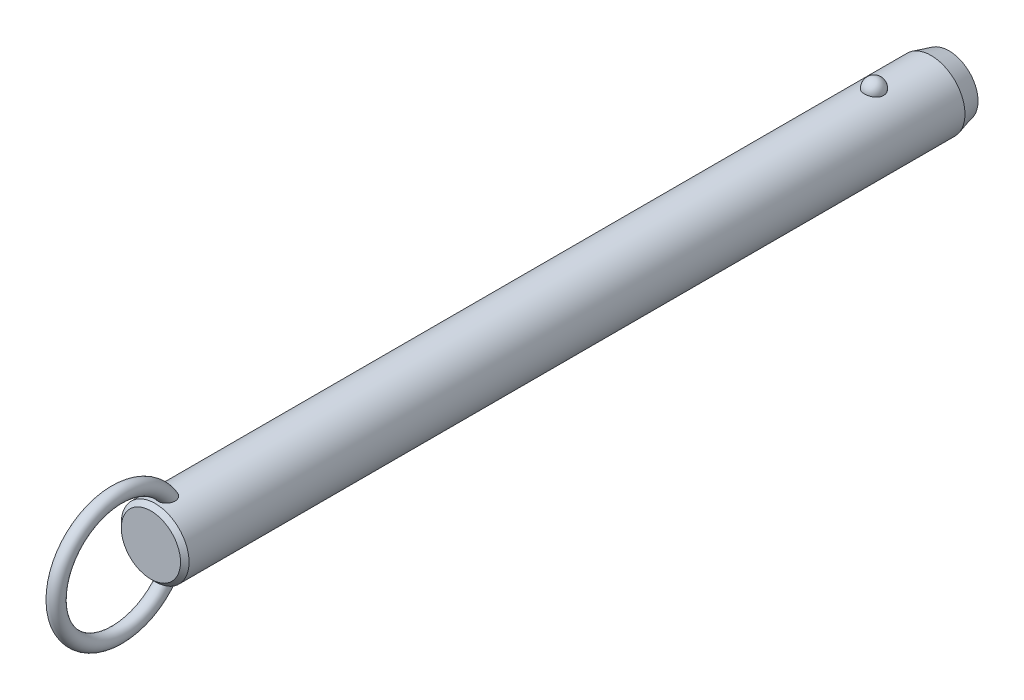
ISO-10303-21;
HEADER;
FILE_DESCRIPTION(('STEP AP214'),'2;1');
FILE_NAME('part.step','',(''),(''),'','','');
FILE_SCHEMA(('AUTOMOTIVE_DESIGN { 1 0 10303 214 1 1 1 1 }'));
ENDSEC;
DATA;
#1=APPLICATION_CONTEXT('core data for automotive mechanical design processes');
#2=APPLICATION_PROTOCOL_DEFINITION('international standard','automotive_design',2000,#1);
#3=PRODUCT_CONTEXT('',#1,'mechanical');
#4=PRODUCT('Part','Part','',(#3));
#5=PRODUCT_RELATED_PRODUCT_CATEGORY('part','',(#4));
#6=PRODUCT_DEFINITION_FORMATION('','',#4);
#7=PRODUCT_DEFINITION_CONTEXT('part definition',#1,'design');
#8=PRODUCT_DEFINITION('design','',#6,#7);
#9=PRODUCT_DEFINITION_SHAPE('','',#8);
#10=(LENGTH_UNIT() NAMED_UNIT(*) SI_UNIT(.MILLI.,.METRE.));
#11=(NAMED_UNIT(*) PLANE_ANGLE_UNIT() SI_UNIT($,.RADIAN.));
#12=(NAMED_UNIT(*) SI_UNIT($,.STERADIAN.) SOLID_ANGLE_UNIT());
#13=UNCERTAINTY_MEASURE_WITH_UNIT(LENGTH_MEASURE(1.E-05),#10,'distance_accuracy_value','');
#14=(GEOMETRIC_REPRESENTATION_CONTEXT(3) GLOBAL_UNCERTAINTY_ASSIGNED_CONTEXT((#13)) GLOBAL_UNIT_ASSIGNED_CONTEXT((#10,
#11,#12)) REPRESENTATION_CONTEXT('',''));
#15=CARTESIAN_POINT('',(0.,0.,0.));
#16=DIRECTION('',(0.,0.,1.));
#17=DIRECTION('',(1.,0.,0.));
#18=AXIS2_PLACEMENT_3D('',#15,#16,#17);
#19=CARTESIAN_POINT('',(0.,0.,190.5));
#20=DIRECTION('',(0.,0.,-1.));
#21=DIRECTION('',(-1.,0.,0.));
#22=AXIS2_PLACEMENT_3D('',#19,#20,#21);
#23=CYLINDRICAL_SURFACE('',#22,9.5);
#24=CARTESIAN_POINT('',(2.67259918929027,9.11631578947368,-2.70000000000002));
#25=CARTESIAN_POINT('',(2.6725968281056,9.11631786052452,-2.54909854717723));
#26=CARTESIAN_POINT('',(2.66030567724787,9.11994722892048,-2.39816735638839));
#27=CARTESIAN_POINT('',(2.6114347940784,9.13405924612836,-2.10058568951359));
#28=CARTESIAN_POINT('',(2.57484658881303,9.14454428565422,-1.95393672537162));
#29=CARTESIAN_POINT('',(2.47830875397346,9.17117631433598,-1.66916069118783));
#30=CARTESIAN_POINT('',(2.41836936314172,9.18732082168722,-1.53102991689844));
#31=CARTESIAN_POINT('',(2.27661331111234,9.22346780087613,-1.26705393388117));
#32=CARTESIAN_POINT('',(2.19479699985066,9.24347021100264,-1.14120852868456));
#33=CARTESIAN_POINT('',(2.01085282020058,9.28522401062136,-0.904632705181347));
#34=CARTESIAN_POINT('',(1.90862396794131,9.30698376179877,-0.793982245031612));
#35=CARTESIAN_POINT('',(1.6867437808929,9.34973971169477,-0.591607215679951));
#36=CARTESIAN_POINT('',(1.56709244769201,9.37073591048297,-0.499882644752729));
#37=CARTESIAN_POINT('',(1.31393976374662,9.40956370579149,-0.33816762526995));
#38=CARTESIAN_POINT('',(1.18048026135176,9.42740444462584,-0.268113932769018));
#39=CARTESIAN_POINT('',(0.903154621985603,9.45799906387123,-0.151390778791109));
#40=CARTESIAN_POINT('',(0.759289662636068,9.47075351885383,-0.104718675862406));
#41=CARTESIAN_POINT('',(0.468074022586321,9.48956256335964,-0.0367633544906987));
#42=CARTESIAN_POINT('',(0.320836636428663,9.49573643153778,-0.015027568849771));
#43=CARTESIAN_POINT('',(0.0246714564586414,9.50112183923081,0.0039619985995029));
#44=CARTESIAN_POINT('',(-0.124256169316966,9.50033406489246,0.00121819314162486));
#45=CARTESIAN_POINT('',(-0.417264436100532,9.4919475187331,-0.0284441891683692));
#46=CARTESIAN_POINT('',(-0.56138413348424,9.48444885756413,-0.0550074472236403));
#47=CARTESIAN_POINT('',(-0.842986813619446,9.46357853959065,-0.131064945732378));
#48=CARTESIAN_POINT('',(-0.980469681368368,9.450206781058,-0.180559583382));
#49=CARTESIAN_POINT('',(-1.24585005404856,9.41890822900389,-0.301476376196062));
#50=CARTESIAN_POINT('',(-1.37368611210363,9.40095498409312,-0.373026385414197));
#51=CARTESIAN_POINT('',(-1.61552738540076,9.3624296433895,-0.53602540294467));
#52=CARTESIAN_POINT('',(-1.72953116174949,9.34185727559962,-0.62747647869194));
#53=CARTESIAN_POINT('',(-1.9429225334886,9.29984568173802,-0.829844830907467));
#54=CARTESIAN_POINT('',(-2.04198021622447,9.27839736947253,-0.941108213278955));
#55=CARTESIAN_POINT('',(-2.2202646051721,9.23735994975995,-1.17883414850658));
#56=CARTESIAN_POINT('',(-2.29948985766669,9.21777097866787,-1.30529781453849));
#57=CARTESIAN_POINT('',(-2.43697287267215,9.18238994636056,-1.57158566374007));
#58=CARTESIAN_POINT('',(-2.49497068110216,9.16664569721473,-1.71155057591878));
#59=CARTESIAN_POINT('',(-2.5872073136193,9.14104303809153,-1.99961197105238));
#60=CARTESIAN_POINT('',(-2.62144683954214,9.13118445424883,-2.1477082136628));
#61=CARTESIAN_POINT('',(-2.66521466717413,9.11850622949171,-2.44715424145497));
#62=CARTESIAN_POINT('',(-2.67484831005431,9.11565658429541,-2.59848735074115));
#63=CARTESIAN_POINT('',(-2.66946735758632,9.11723375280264,-2.90067317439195));
#64=CARTESIAN_POINT('',(-2.65445345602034,9.12166036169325,-3.05152590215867));
#65=CARTESIAN_POINT('',(-2.6002971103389,9.13724422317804,-3.34766110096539));
#66=CARTESIAN_POINT('',(-2.56127978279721,9.14836656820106,-3.49296833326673));
#67=CARTESIAN_POINT('',(-2.46018844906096,9.17606676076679,-3.77477535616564));
#68=CARTESIAN_POINT('',(-2.39811349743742,9.19264483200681,-3.91127478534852));
#69=CARTESIAN_POINT('',(-2.25202303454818,9.22952198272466,-4.17244273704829));
#70=CARTESIAN_POINT('',(-2.16788714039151,9.24984129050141,-4.29704106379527));
#71=CARTESIAN_POINT('',(-1.9799408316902,9.29188255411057,-4.53013066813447));
#72=CARTESIAN_POINT('',(-1.87612963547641,9.31360456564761,-4.63862130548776));
#73=CARTESIAN_POINT('',(-1.65105429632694,9.35612959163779,-4.83690299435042));
#74=CARTESIAN_POINT('',(-1.52972405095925,9.37692871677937,-4.9266199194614));
#75=CARTESIAN_POINT('',(-1.27318250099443,9.41518970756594,-5.08429106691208));
#76=CARTESIAN_POINT('',(-1.13797219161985,9.432651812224,-5.15224684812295));
#77=CARTESIAN_POINT('',(-0.859280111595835,9.46208255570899,-5.26371827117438));
#78=CARTESIAN_POINT('',(-0.715925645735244,9.47411833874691,-5.30753421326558));
#79=CARTESIAN_POINT('',(-0.423550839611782,9.4916822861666,-5.37076321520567));
#80=CARTESIAN_POINT('',(-0.2745312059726,9.49721125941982,-5.39017930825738));
#81=CARTESIAN_POINT('',(0.0218446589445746,9.50110860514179,-5.40390587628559));
#82=CARTESIAN_POINT('',(0.16917707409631,9.49961381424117,-5.39869609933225));
#83=CARTESIAN_POINT('',(0.460808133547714,9.48993906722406,-5.36441955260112));
#84=CARTESIAN_POINT('',(0.605106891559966,9.48175936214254,-5.33535367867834));
#85=CARTESIAN_POINT('',(0.886027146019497,9.4596376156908,-5.25435587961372));
#86=CARTESIAN_POINT('',(1.02267710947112,9.44571881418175,-5.20251612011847));
#87=CARTESIAN_POINT('',(1.28523827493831,9.41358993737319,-5.07741549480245));
#88=CARTESIAN_POINT('',(1.41114877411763,9.39537958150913,-5.00415322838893));
#89=CARTESIAN_POINT('',(1.65085227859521,9.3562644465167,-4.83684599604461));
#90=CARTESIAN_POINT('',(1.76442346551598,9.33532178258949,-4.74249218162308));
#91=CARTESIAN_POINT('',(1.97425672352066,9.29321198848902,-4.53620389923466));
#92=CARTESIAN_POINT('',(2.07051582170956,9.27204482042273,-4.42426641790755));
#93=CARTESIAN_POINT('',(2.24490086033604,9.23139221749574,-4.18363183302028));
#94=CARTESIAN_POINT('',(2.32267019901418,9.21194380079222,-4.05466990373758));
#95=CARTESIAN_POINT('',(2.45584092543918,9.1773419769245,-3.78517836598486));
#96=CARTESIAN_POINT('',(2.51124979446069,9.16218713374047,-3.644652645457));
#97=CARTESIAN_POINT('',(2.59380876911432,9.13913522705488,-3.37104301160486));
#98=CARTESIAN_POINT('',(2.62330266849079,9.13064624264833,-3.23871053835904));
#99=CARTESIAN_POINT('',(2.66269870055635,9.11923566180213,-2.97092664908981));
#100=CARTESIAN_POINT('',(2.67260130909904,9.11631393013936,-2.83547530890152));
#101=CARTESIAN_POINT('',(2.67259918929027,9.11631578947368,-2.70000000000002));
#102=B_SPLINE_CURVE_WITH_KNOTS('',3,(#24,#25,#26,#27,#28,#29,#30,#31,#32,#33,#34,#35,#36,#37,
#38,#39,#40,#41,#42,#43,#44,#45,#46,#47,#48,#49,#50,#51,#52,#53,#54,#55,#56,#57,#58,#59,#60,#61,
#62,#63,#64,#65,#66,#67,#68,#69,#70,#71,#72,#73,#74,#75,#76,#77,#78,#79,#80,#81,#82,#83,#84,#85,
#86,#87,#88,#89,#90,#91,#92,#93,#94,#95,#96,#97,#98,#99,#100,#101),.UNSPECIFIED.,.T.,.F.,(4,2,2,
2,2,2,2,2,2,2,2,2,2,2,2,2,2,2,2,2,2,2,2,2,2,2,2,2,2,2,2,2,2,2,2,2,2,2,4),(0.,0.452217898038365,
0.904593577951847,1.35677112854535,1.80894144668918,2.26340676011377,2.71787203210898,
3.17099820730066,3.62407318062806,4.0687883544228,4.51345969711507,4.95160616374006,
5.38976021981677,5.83050358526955,6.27129275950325,6.72071308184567,7.17016633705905,
7.62495278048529,8.07972578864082,8.53254856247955,8.98535859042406,9.43582813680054,
9.88631615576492,10.3393155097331,10.7923328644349,11.2471065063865,11.7018475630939,
12.150795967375,12.5996885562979,13.0398725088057,13.4800399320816,13.9184421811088,
14.3568730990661,14.802202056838,15.2476074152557,15.7010097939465,16.1542603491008,
16.5602594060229,16.9662486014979),.UNSPECIFIED.);
#103=CARTESIAN_POINT('',(2.67259918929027,9.11631578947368,-2.70000000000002));
#104=VERTEX_POINT('',#103);
#105=EDGE_CURVE('E41',#104,#104,#102,.T.);
#106=ORIENTED_EDGE('',*,*,#105,.T.);
#107=EDGE_LOOP('',(#106));
#108=FACE_BOUND('',#107,.T.);
#109=CARTESIAN_POINT('',(0.,0.,198.82));
#110=DIRECTION('',(0.,0.,1.));
#111=DIRECTION('',(1.,0.,0.));
#112=AXIS2_PLACEMENT_3D('',#109,#110,#111);
#113=CIRCLE('',#112,9.5);
#114=CARTESIAN_POINT('',(9.5,0.,198.82));
#115=VERTEX_POINT('',#114);
#116=EDGE_CURVE('E10',#115,#115,#113,.F.);
#117=ORIENTED_EDGE('',*,*,#116,.T.);
#118=EDGE_LOOP('',(#117));
#119=FACE_BOUND('',#118,.T.);
#120=CARTESIAN_POINT('',(-0.697062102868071,-9.47439269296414,193.167808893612));
#121=CARTESIAN_POINT('',(-0.799579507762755,-9.46685146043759,193.207482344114));
#122=CARTESIAN_POINT('',(-0.898575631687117,-9.45788043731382,193.2559309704));
#123=CARTESIAN_POINT('',(-1.08670047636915,-9.43811593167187,193.368868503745));
#124=CARTESIAN_POINT('',(-1.17583204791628,-9.42732297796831,193.433352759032));
#125=CARTESIAN_POINT('',(-1.34179806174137,-9.40513672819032,193.576209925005));
#126=CARTESIAN_POINT('',(-1.41865133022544,-9.39374438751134,193.654561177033));
#127=CARTESIAN_POINT('',(-1.55860047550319,-9.37154196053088,193.822752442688));
#128=CARTESIAN_POINT('',(-1.62169476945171,-9.3607319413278,193.91259377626));
#129=CARTESIAN_POINT('',(-1.73527695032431,-9.34035749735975,194.104500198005));
#130=CARTESIAN_POINT('',(-1.78522266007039,-9.33085270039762,194.206891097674));
#131=CARTESIAN_POINT('',(-1.86924997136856,-9.3143834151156,194.418148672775));
#132=CARTESIAN_POINT('',(-1.90332570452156,-9.30741986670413,194.527017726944));
#133=CARTESIAN_POINT('',(-1.95893603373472,-9.29588482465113,194.760473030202));
#134=CARTESIAN_POINT('',(-1.97872420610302,-9.29165182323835,194.885489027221));
#135=CARTESIAN_POINT('',(-2.00062129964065,-9.28695978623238,195.137080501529));
#136=CARTESIAN_POINT('',(-2.00272284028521,-9.28650232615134,195.263656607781));
#137=CARTESIAN_POINT('',(-1.98958876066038,-9.28932750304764,195.536815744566));
#138=CARTESIAN_POINT('',(-1.97143366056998,-9.2932400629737,195.683251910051));
#139=CARTESIAN_POINT('',(-1.91479925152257,-9.30507151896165,195.972062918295));
#140=CARTESIAN_POINT('',(-1.87629122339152,-9.31299607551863,196.114431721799));
#141=CARTESIAN_POINT('',(-1.77225683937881,-9.33340232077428,196.415172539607));
#142=CARTESIAN_POINT('',(-1.70334898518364,-9.34641636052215,196.572369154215));
#143=CARTESIAN_POINT('',(-1.58111062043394,-9.36759153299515,196.797517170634));
#144=CARTESIAN_POINT('',(-1.53721459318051,-9.37492619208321,196.870796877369));
#145=CARTESIAN_POINT('',(-1.4430263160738,-9.38988566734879,197.01307405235));
#146=CARTESIAN_POINT('',(-1.39273721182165,-9.39751033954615,197.082073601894));
#147=CARTESIAN_POINT('',(-1.26775962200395,-9.41530678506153,197.236983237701));
#148=CARTESIAN_POINT('',(-1.19052326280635,-9.42548108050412,197.320871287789));
#149=CARTESIAN_POINT('',(-1.02420241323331,-9.44499825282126,197.476008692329));
#150=CARTESIAN_POINT('',(-0.93513986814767,-9.45434261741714,197.547280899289));
#151=CARTESIAN_POINT('',(-0.766610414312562,-9.46930670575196,197.658695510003));
#152=CARTESIAN_POINT('',(-0.689439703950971,-9.47529223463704,197.702235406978));
#153=CARTESIAN_POINT('',(-0.528942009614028,-9.48560294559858,197.77631336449));
#154=CARTESIAN_POINT('',(-0.445620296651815,-9.48992953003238,197.806862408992));
#155=CARTESIAN_POINT('',(-0.273901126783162,-9.49644161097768,197.852579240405));
#156=CARTESIAN_POINT('',(-0.18546574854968,-9.49860811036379,197.86761059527));
#157=CARTESIAN_POINT('',(-0.00734541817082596,-9.5004135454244,197.880149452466));
#158=CARTESIAN_POINT('',(0.0823387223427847,-9.50005405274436,197.877667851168));
#159=CARTESIAN_POINT('',(0.247679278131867,-9.49708301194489,197.856995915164));
#160=CARTESIAN_POINT('',(0.323620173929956,-9.49477609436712,197.840930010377));
#161=CARTESIAN_POINT('',(0.471981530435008,-9.48855917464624,197.797172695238));
#162=CARTESIAN_POINT('',(0.544400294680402,-9.48464840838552,197.769475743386));
#163=CARTESIAN_POINT('',(0.708947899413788,-9.47398336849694,197.69280266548));
#164=CARTESIAN_POINT('',(0.799149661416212,-9.46671310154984,197.639774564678));
#165=CARTESIAN_POINT('',(0.969783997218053,-9.45076225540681,197.519973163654));
#166=CARTESIAN_POINT('',(1.050194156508,-9.44207854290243,197.453169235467));
#167=CARTESIAN_POINT('',(1.23092343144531,-9.42051459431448,197.280759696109));
#168=CARTESIAN_POINT('',(1.32652499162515,-9.40733378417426,197.17026193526));
#169=CARTESIAN_POINT('',(1.49893121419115,-9.38140745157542,196.935561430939));
#170=CARTESIAN_POINT('',(1.5757161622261,-9.36866239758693,196.811344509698));
#171=CARTESIAN_POINT('',(1.71285426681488,-9.34457644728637,196.549389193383));
#172=CARTESIAN_POINT('',(1.77266365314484,-9.33328726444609,196.41136233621));
#173=CARTESIAN_POINT('',(1.87239208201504,-9.31379209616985,196.128051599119));
#174=CARTESIAN_POINT('',(1.91230158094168,-9.3055875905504,195.982764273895));
#175=CARTESIAN_POINT('',(1.97604189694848,-9.29228394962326,195.662028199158));
#176=CARTESIAN_POINT('',(1.9958743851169,-9.28797202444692,195.485724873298));
#177=CARTESIAN_POINT('',(2.0029570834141,-9.28645519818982,195.132414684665));
#178=CARTESIAN_POINT('',(1.99025930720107,-9.28923895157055,194.955409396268));
#179=CARTESIAN_POINT('',(1.93735479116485,-9.30038134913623,194.656338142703));
#180=CARTESIAN_POINT('',(1.90576827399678,-9.30697680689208,194.532667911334));
#181=CARTESIAN_POINT('',(1.8228748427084,-9.32356855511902,194.292329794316));
#182=CARTESIAN_POINT('',(1.77158213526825,-9.33356239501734,194.175656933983));
#183=CARTESIAN_POINT('',(1.64885744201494,-9.35602275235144,193.952706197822));
#184=CARTESIAN_POINT('',(1.57730995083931,-9.36850332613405,193.846492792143));
#185=CARTESIAN_POINT('',(1.41543264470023,-9.39431873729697,193.649553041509));
#186=CARTESIAN_POINT('',(1.32510883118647,-9.40765330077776,193.558821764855));
#187=CARTESIAN_POINT('',(1.13846223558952,-9.43195720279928,193.405033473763));
#188=CARTESIAN_POINT('',(1.04369890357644,-9.44302894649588,193.340094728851));
#189=CARTESIAN_POINT('',(0.843965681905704,-9.46296805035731,193.228038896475));
#190=CARTESIAN_POINT('',(0.739000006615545,-9.47183631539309,193.180914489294));
#191=CARTESIAN_POINT('',(0.528175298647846,-9.48586140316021,193.108117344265));
#192=CARTESIAN_POINT('',(0.422686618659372,-9.49119633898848,193.08140249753));
#193=CARTESIAN_POINT('',(0.208590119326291,-9.49831365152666,193.046013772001));
#194=CARTESIAN_POINT('',(0.0999817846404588,-9.500095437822,193.037342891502));
#195=CARTESIAN_POINT('',(-0.126104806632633,-9.49988861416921,193.038350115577));
#196=CARTESIAN_POINT('',(-0.243578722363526,-9.49757821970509,193.049594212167));
#197=CARTESIAN_POINT('',(-0.474390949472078,-9.48885165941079,193.093167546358));
#198=CARTESIAN_POINT('',(-0.587729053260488,-9.48243528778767,193.125497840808));
#199=CARTESIAN_POINT('',(-0.697062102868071,-9.47439269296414,193.167808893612));
#200=B_SPLINE_CURVE_WITH_KNOTS('',3,(#120,#121,#122,#123,#124,#125,#126,#127,#128,#129,#130,
#131,#132,#133,#134,#135,#136,#137,#138,#139,#140,#141,#142,#143,#144,#145,#146,#147,#148,#149,
#150,#151,#152,#153,#154,#155,#156,#157,#158,#159,#160,#161,#162,#163,#164,#165,#166,#167,#168,
#169,#170,#171,#172,#173,#174,#175,#176,#177,#178,#179,#180,#181,#182,#183,#184,#185,#186,#187,
#188,#189,#190,#191,#192,#193,#194,#195,#196,#197,#198,#199),.UNSPECIFIED.,.T.,.F.,(4,2,2,2,2,2,
2,2,2,2,2,2,2,2,2,2,2,2,2,2,2,2,2,2,2,2,2,2,2,2,2,2,2,2,2,2,2,2,2,4),(0.,0.330119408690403,
0.660143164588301,0.989655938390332,1.31920659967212,1.66074728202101,2.00241415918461,
2.38088696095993,2.75951768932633,3.20065679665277,3.64242004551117,4.15620996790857,
4.4131416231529,4.66994734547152,5.01228664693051,5.35399933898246,5.61943037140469,
5.88463652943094,6.15215502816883,6.4195070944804,6.65144391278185,6.88349136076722,
7.19641200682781,7.51003602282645,7.94779711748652,8.3860149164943,8.83699707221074,
9.28819530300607,9.81778662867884,10.34653170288,10.7284172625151,11.1100280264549,
11.4938603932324,11.8775702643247,12.2220189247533,12.5663259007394,12.8915939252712,
13.2169159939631,13.5689650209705,13.9210316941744),.UNSPECIFIED.);
#201=CARTESIAN_POINT('',(-0.697062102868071,-9.47439269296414,193.167808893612));
#202=VERTEX_POINT('',#201);
#203=EDGE_CURVE('E58',#202,#202,#200,.T.);
#204=ORIENTED_EDGE('',*,*,#203,.T.);
#205=EDGE_LOOP('',(#204));
#206=FACE_BOUND('',#205,.T.);
#207=CARTESIAN_POINT('',(-0.697062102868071,9.47439269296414,193.167808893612));
#208=CARTESIAN_POINT('',(-0.597792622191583,9.48169483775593,193.12939564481));
#209=CARTESIAN_POINT('',(-0.495106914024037,9.48766580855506,193.099168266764));
#210=CARTESIAN_POINT('',(-0.285876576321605,9.49627648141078,193.056032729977));
#211=CARTESIAN_POINT('',(-0.179324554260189,9.49890941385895,193.043159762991));
#212=CARTESIAN_POINT('',(0.0344157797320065,9.50053798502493,193.035166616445));
#213=CARTESIAN_POINT('',(0.141603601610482,9.49953613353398,193.040034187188));
#214=CARTESIAN_POINT('',(0.35356357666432,9.49401038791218,193.067365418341));
#215=CARTESIAN_POINT('',(0.458336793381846,9.48948807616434,193.08982117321));
#216=CARTESIAN_POINT('',(0.662493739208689,9.4774236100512,193.151671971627));
#217=CARTESIAN_POINT('',(0.761881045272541,9.46988348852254,193.191055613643));
#218=CARTESIAN_POINT('',(0.95260839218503,9.45260382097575,193.285634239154));
#219=CARTESIAN_POINT('',(1.04394806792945,9.44286417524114,193.340829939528));
#220=CARTESIAN_POINT('',(1.21712767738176,9.42211760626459,193.466066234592));
#221=CARTESIAN_POINT('',(1.29885671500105,9.41109835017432,193.536257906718));
#222=CARTESIAN_POINT('',(1.44978975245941,9.38903310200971,193.688980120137));
#223=CARTESIAN_POINT('',(1.51899278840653,9.37798710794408,193.771511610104));
#224=CARTESIAN_POINT('',(1.64602857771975,9.35654375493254,193.949776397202));
#225=CARTESIAN_POINT('',(1.70333052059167,9.34618688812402,194.045891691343));
#226=CARTESIAN_POINT('',(1.80259341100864,9.32755128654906,194.245897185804));
#227=CARTESIAN_POINT('',(1.84454942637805,9.31927322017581,194.349789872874));
#228=CARTESIAN_POINT('',(1.91637039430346,9.30478365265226,194.572213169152));
#229=CARTESIAN_POINT('',(1.944805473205,9.29882552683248,194.691219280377));
#230=CARTESIAN_POINT('',(1.98449865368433,9.29043398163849,194.932143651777));
#231=CARTESIAN_POINT('',(1.99574908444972,9.28800213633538,195.054063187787));
#232=CARTESIAN_POINT('',(2.00275141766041,9.28649645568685,195.316932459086));
#233=CARTESIAN_POINT('',(1.99588238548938,9.28799035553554,195.457952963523));
#234=CARTESIAN_POINT('',(1.96270559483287,9.29505517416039,195.737621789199));
#235=CARTESIAN_POINT('',(1.93637872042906,9.30063010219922,195.876267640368));
#236=CARTESIAN_POINT('',(1.85949176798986,9.31633564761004,196.172561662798));
#237=CARTESIAN_POINT('',(1.80549792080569,9.3270926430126,196.329290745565));
#238=CARTESIAN_POINT('',(1.67376869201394,9.3516306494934,196.632284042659));
#239=CARTESIAN_POINT('',(1.59603181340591,9.36541185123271,196.778547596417));
#240=CARTESIAN_POINT('',(1.43602774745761,9.39110706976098,197.025813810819));
#241=CARTESIAN_POINT('',(1.35831795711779,9.40278656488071,197.129791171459));
#242=CARTESIAN_POINT('',(1.18774483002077,9.42585025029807,197.324534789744));
#243=CARTESIAN_POINT('',(1.09490932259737,9.43723493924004,197.415324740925));
#244=CARTESIAN_POINT('',(0.921110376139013,9.45552616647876,197.55620334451));
#245=CARTESIAN_POINT('',(0.843738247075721,9.46281058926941,197.610656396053));
#246=CARTESIAN_POINT('',(0.681245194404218,9.47589120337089,197.706711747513));
#247=CARTESIAN_POINT('',(0.596135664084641,9.48168953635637,197.748332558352));
#248=CARTESIAN_POINT('',(0.433779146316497,9.49038144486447,197.810089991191));
#249=CARTESIAN_POINT('',(0.357459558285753,9.49359170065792,197.83260136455));
#250=CARTESIAN_POINT('',(0.202074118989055,9.49816761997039,197.864574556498));
#251=CARTESIAN_POINT('',(0.123010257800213,9.49953459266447,197.874045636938));
#252=CARTESIAN_POINT('',(-0.03573724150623,9.50026497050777,197.879114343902));
#253=CARTESIAN_POINT('',(-0.115421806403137,9.49962433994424,197.874684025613));
#254=CARTESIAN_POINT('',(-0.272823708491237,9.49640854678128,197.852296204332));
#255=CARTESIAN_POINT('',(-0.350540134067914,9.4938325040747,197.834332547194));
#256=CARTESIAN_POINT('',(-0.500580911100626,9.48709462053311,197.786802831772));
#257=CARTESIAN_POINT('',(-0.572979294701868,9.48296359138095,197.757461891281));
#258=CARTESIAN_POINT('',(-0.712864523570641,9.47347609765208,197.689008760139));
#259=CARTESIAN_POINT('',(-0.780349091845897,9.46811906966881,197.649892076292));
#260=CARTESIAN_POINT('',(-0.946309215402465,9.45329720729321,197.539432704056));
#261=CARTESIAN_POINT('',(-1.04090230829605,9.44321512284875,197.462329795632));
#262=CARTESIAN_POINT('',(-1.21661929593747,9.42219227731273,197.29409718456));
#263=CARTESIAN_POINT('',(-1.29770519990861,9.41124921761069,197.202929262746));
#264=CARTESIAN_POINT('',(-1.47319646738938,9.38563439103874,196.976162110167));
#265=CARTESIAN_POINT('',(-1.56208878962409,9.37102009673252,196.836289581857));
#266=CARTESIAN_POINT('',(-1.71623987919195,9.34401559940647,196.543950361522));
#267=CARTESIAN_POINT('',(-1.78147866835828,9.33162728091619,196.391473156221));
#268=CARTESIAN_POINT('',(-1.88853837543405,9.31055541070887,196.075647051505));
#269=CARTESIAN_POINT('',(-1.92998995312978,9.30193076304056,195.912168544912));
#270=CARTESIAN_POINT('',(-1.98590726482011,9.29015757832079,195.580526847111));
#271=CARTESIAN_POINT('',(-2.0004070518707,9.2870021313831,195.412369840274));
#272=CARTESIAN_POINT('',(-1.99964701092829,9.28716218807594,195.105080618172));
#273=CARTESIAN_POINT('',(-1.98908145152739,9.28945704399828,194.965936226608));
#274=CARTESIAN_POINT('',(-1.94566294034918,9.29865169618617,194.691153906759));
#275=CARTESIAN_POINT('',(-1.9128206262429,9.30554929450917,194.555514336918));
#276=CARTESIAN_POINT('',(-1.84582133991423,9.31898248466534,194.357802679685));
#277=CARTESIAN_POINT('',(-1.82038084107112,9.32400364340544,194.292583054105));
#278=CARTESIAN_POINT('',(-1.76350511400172,9.33492884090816,194.164903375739));
#279=CARTESIAN_POINT('',(-1.73207305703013,9.34083241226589,194.102441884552));
#280=CARTESIAN_POINT('',(-1.66324243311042,9.35333332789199,193.98094078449));
#281=CARTESIAN_POINT('',(-1.62584239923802,9.35993084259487,193.921902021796));
#282=CARTESIAN_POINT('',(-1.54527678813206,9.37356864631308,193.807987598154));
#283=CARTESIAN_POINT('',(-1.50211241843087,9.38060884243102,193.753111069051));
#284=CARTESIAN_POINT('',(-1.3768114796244,9.40004442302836,193.609961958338));
#285=CARTESIAN_POINT('',(-1.28916358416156,9.41261047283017,193.526429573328));
#286=CARTESIAN_POINT('',(-1.09996826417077,9.43658180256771,193.377236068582));
#287=CARTESIAN_POINT('',(-0.998461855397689,9.44799034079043,193.311523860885));
#288=CARTESIAN_POINT('',(-0.860188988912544,9.46103017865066,193.2394367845));
#289=CARTESIAN_POINT('',(-0.828141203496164,9.46389141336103,193.223851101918));
#290=CARTESIAN_POINT('',(-0.763210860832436,9.46934915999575,193.194473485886));
#291=CARTESIAN_POINT('',(-0.730328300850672,9.47194567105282,193.180681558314));
#292=CARTESIAN_POINT('',(-0.697062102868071,9.47439269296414,193.167808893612));
#293=B_SPLINE_CURVE_WITH_KNOTS('',3,(#207,#208,#209,#210,#211,#212,#213,#214,#215,#216,#217,
#218,#219,#220,#221,#222,#223,#224,#225,#226,#227,#228,#229,#230,#231,#232,#233,#234,#235,#236,
#237,#238,#239,#240,#241,#242,#243,#244,#245,#246,#247,#248,#249,#250,#251,#252,#253,#254,#255,
#256,#257,#258,#259,#260,#261,#262,#263,#264,#265,#266,#267,#268,#269,#270,#271,#272,#273,#274,
#275,#276,#277,#278,#279,#280,#281,#282,#283,#284,#285,#286,#287,#288,#289,#290,#291,#292),
.UNSPECIFIED.,.T.,.F.,(4,2,2,2,2,2,2,2,2,2,2,2,2,2,2,2,2,2,2,2,2,2,2,2,2,2,2,2,2,2,2,2,2,2,2,2,
2,2,2,2,2,2,4),(0.,0.319942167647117,0.640532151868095,0.96090081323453,1.2811255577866,
1.60113495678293,1.92115886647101,2.24457323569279,2.56801248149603,2.90371927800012,
3.23953387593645,3.60560313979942,3.97183576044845,4.39383693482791,4.8162532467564,
5.31257045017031,5.80891895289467,6.19868344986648,6.58773876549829,6.87145417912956,
7.15475838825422,7.39263751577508,7.63034760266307,7.86853584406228,8.10683246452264,
8.3406366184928,8.57454843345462,8.93983939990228,9.30614105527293,9.80266668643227,
10.2996107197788,10.8040753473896,11.3079021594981,11.7249776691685,12.1418541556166,
12.3521485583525,12.5623319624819,12.7725671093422,12.9827582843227,13.345827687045,
13.7078449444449,13.8150604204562,13.9222762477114),.UNSPECIFIED.);
#294=CARTESIAN_POINT('',(-0.697062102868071,9.47439269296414,193.167808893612));
#295=VERTEX_POINT('',#294);
#296=EDGE_CURVE('E66',#295,#295,#293,.T.);
#297=ORIENTED_EDGE('',*,*,#296,.T.);
#298=EDGE_LOOP('',(#297));
#299=FACE_BOUND('',#298,.T.);
#300=CARTESIAN_POINT('',(0.,0.,-18.6999999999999));
#301=DIRECTION('',(0.,0.,-1.));
#302=DIRECTION('',(-1.,0.,0.));
#303=AXIS2_PLACEMENT_3D('',#300,#301,#302);
#304=CIRCLE('',#303,9.5);
#305=CARTESIAN_POINT('',(-9.5,0.,-18.6999999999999));
#306=VERTEX_POINT('',#305);
#307=EDGE_CURVE('E55',#306,#306,#304,.F.);
#308=ORIENTED_EDGE('',*,*,#307,.T.);
#309=EDGE_LOOP('',(#308));
#310=FACE_BOUND('',#309,.T.);
#311=ADVANCED_FACE('F37',(#108,#119,#206,#299,#310),#23,.T.);
#312=CARTESIAN_POINT('',(0.,0.,-23.7));
#313=DIRECTION('',(0.,0.,-1.));
#314=DIRECTION('',(-1.,0.,0.));
#315=AXIS2_PLACEMENT_3D('',#312,#313,#314);
#316=PLANE('',#315);
#317=CARTESIAN_POINT('',(0.,0.,-23.7));
#318=DIRECTION('',(0.,0.,-1.));
#319=DIRECTION('',(-1.,0.,0.));
#320=AXIS2_PLACEMENT_3D('',#317,#318,#319);
#321=CIRCLE('',#320,8.16025403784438);
#322=CARTESIAN_POINT('',(-8.16025403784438,0.,-23.7));
#323=VERTEX_POINT('',#322);
#324=EDGE_CURVE('E65',#323,#323,#321,.T.);
#325=ORIENTED_EDGE('',*,*,#324,.T.);
#326=EDGE_LOOP('',(#325));
#327=FACE_BOUND('',#326,.T.);
#328=ADVANCED_FACE('F84',(#327),#316,.T.);
#329=CARTESIAN_POINT('',(0.,0.,-23.7));
#330=DIRECTION('',(0.,0.,1.));
#331=DIRECTION('',(1.,0.,0.));
#332=AXIS2_PLACEMENT_3D('',#329,#330,#331);
#333=CONICAL_SURFACE('',#332,8.16025403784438,0.261799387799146);
#334=ORIENTED_EDGE('',*,*,#307,.F.);
#335=EDGE_LOOP('',(#334));
#336=FACE_BOUND('',#335,.T.);
#337=ORIENTED_EDGE('',*,*,#324,.F.);
#338=EDGE_LOOP('',(#337));
#339=FACE_BOUND('',#338,.T.);
#340=ADVANCED_FACE('F82',(#336,#339),#333,.T.);
#341=CARTESIAN_POINT('',(0.,0.,200.02));
#342=DIRECTION('',(0.,0.,1.));
#343=DIRECTION('',(1.,0.,0.));
#344=AXIS2_PLACEMENT_3D('',#341,#342,#343);
#345=PLANE('',#344);
#346=CARTESIAN_POINT('',(0.,0.,200.02));
#347=DIRECTION('',(0.,0.,1.));
#348=DIRECTION('',(1.,0.,0.));
#349=AXIS2_PLACEMENT_3D('',#346,#347,#348);
#350=CIRCLE('',#349,8.29999999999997);
#351=CARTESIAN_POINT('',(8.29999999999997,0.,200.02));
#352=VERTEX_POINT('',#351);
#353=EDGE_CURVE('E50',#352,#352,#350,.T.);
#354=ORIENTED_EDGE('',*,*,#353,.T.);
#355=EDGE_LOOP('',(#354));
#356=FACE_BOUND('',#355,.T.);
#357=ADVANCED_FACE('F76',(#356),#345,.T.);
#358=CARTESIAN_POINT('',(0.,0.,209.55));
#359=DIRECTION('',(1.,0.,0.));
#360=DIRECTION('',(0.,0.,-1.));
#361=AXIS2_PLACEMENT_3D('',#358,#359,#360);
#362=TOROIDAL_SURFACE('',#361,17.05,2.);
#363=ORIENTED_EDGE('',*,*,#296,.F.);
#364=EDGE_LOOP('',(#363));
#365=FACE_BOUND('',#364,.T.);
#366=ORIENTED_EDGE('',*,*,#203,.F.);
#367=EDGE_LOOP('',(#366));
#368=FACE_BOUND('',#367,.T.);
#369=ADVANCED_FACE('F72',(#365,#368),#362,.T.);
#370=CARTESIAN_POINT('',(0.,0.,200.02));
#371=DIRECTION('',(0.,0.,-1.));
#372=DIRECTION('',(-1.,0.,0.));
#373=AXIS2_PLACEMENT_3D('',#370,#371,#372);
#374=CONICAL_SURFACE('',#373,8.29999999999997,0.785398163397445);
#375=ORIENTED_EDGE('',*,*,#116,.F.);
#376=EDGE_LOOP('',(#375));
#377=FACE_BOUND('',#376,.T.);
#378=ORIENTED_EDGE('',*,*,#353,.F.);
#379=EDGE_LOOP('',(#378));
#380=FACE_BOUND('',#379,.T.);
#381=ADVANCED_FACE('F39',(#377,#380),#374,.T.);
#382=CARTESIAN_POINT('',(0.,9.5,-2.70000000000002));
#383=DIRECTION('',(0.,1.,0.));
#384=DIRECTION('',(0.,0.,-1.));
#385=AXIS2_PLACEMENT_3D('',#382,#383,#384);
#386=SPHERICAL_SURFACE('',#385,2.7);
#387=ORIENTED_EDGE('',*,*,#105,.F.);
#388=EDGE_LOOP('',(#387));
#389=FACE_BOUND('',#388,.T.);
#390=ADVANCED_FACE('F78',(#389),#386,.T.);
#391=CLOSED_SHELL('',(#311,#328,#340,#357,#369,#381,#390));
#392=MANIFOLD_SOLID_BREP('B2',#391);
#393=ADVANCED_BREP_SHAPE_REPRESENTATION('',(#18,#392),#14);
#394=SHAPE_DEFINITION_REPRESENTATION(#9,#393);
ENDSEC;
END-ISO-10303-21;
